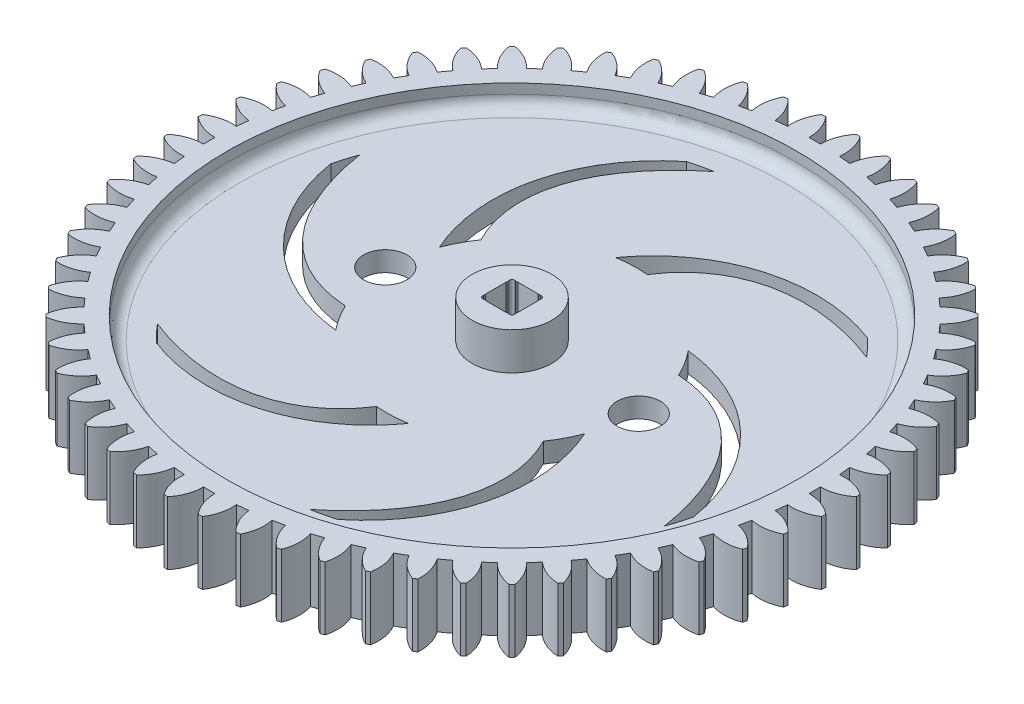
from build123d import *

# Parameters (mm, degrees)
EXTRUDE3_DEPTH     = 3.175
CIRPATTERN1_COUNT  = 60
CUT_EXTRUDE2_DEPTH = 9.52
CUT_EXTRUDE3_DEPTH = 2
CIRPATTERN2_COUNT  = 6
SKETCH8_R          = 2.175
CUT_EXTRUDE4_DEPTH = 2
FILLET1_R          = 0.25
FILLET2_R          = 1.2


with BuildPart() as part:
    # Sketch3 → Revolve1 (revolve)
    with BuildSketch(Plane.XY, mode=Mode.PRIVATE) as revolve1_sk:
        Polygon((0, 4.76), (4, 4.76), (4, 1), (28.61, 1), (28.61, 3.175), (30.41, 3.175), (30.41, -3.175), (28.61, -3.175), (28.61, -1), (4, -1), (4, -4.76), (0, -4.76), align=None)
    revolve(revolve1_sk.sketch.rotate(Axis((0, 37.828653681, 0), (0, -1, 0)), 90), axis=Axis((0, 37.828653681, 0), (0, -1, 0)))

    # Sketch4 → Extrude3 (add, symmetric)
    with BuildSketch(Plane(origin=(0, 0, 0), x_dir=(1, 0, 0), z_dir=(0, 1, 0))):
        with BuildLine():
            ThreePointArc((-1.532288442, 33.064514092), (-1.732320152, 33.0546376), (-1.932288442, 33.04355098))
            ThreePointArc((-1.932288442, 33.04355098), (-2.541297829, 31.594297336), (-2.574792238, 30.022640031))
            ThreePointArc((-2.574792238, 30.022640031), (-1.577031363, 30.091551), (-0.577533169, 30.127311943))
            ThreePointArc((-0.577533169, 30.127311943), (-0.775127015, 31.686858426), (-1.532288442, 33.064514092))
        make_face()
    extrude3 = extrude(amount=EXTRUDE3_DEPTH, both=True)

    # CirPattern1: Extrude3 ×60 about axis
    cirpattern1_axis = Axis((0, 0, 0), (0, 1, 0))
    for i in range(1, CIRPATTERN1_COUNT):
        add(extrude3.rotate(cirpattern1_axis, i * 360 / CIRPATTERN1_COUNT))

    # Sketch6 → Cut-Extrude2 (cut)
    with BuildSketch(Plane(origin=(0, 4.76, 0), x_dir=(1, 0, 0), z_dir=(0, 1, 0))):
        Polygon((-1.2325, 1.6125), (-1.6125, 1.6125), (-1.6125, 1.2325), (-1.563002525, 1.183002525), (-1.6125, 1.133505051), (-1.563002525, 1.084007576), (-1.6125, 1.034510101), (-1.6125, -1.034510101), (-1.563002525, -1.084007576), (-1.6125, -1.133505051), (-1.563002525, -1.183002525), (-1.6125, -1.2325), (-1.6125, -1.6125), (-1.2325, -1.6125), (-1.1825, -1.5425), (-1.1325, -1.6125), (-1.0825, -1.5425), (-1.0325, -1.6125), (1.0325, -1.6125), (1.0825, -1.5425), (1.1325, -1.6125), (1.1825, -1.5425), (1.2325, -1.6125), (1.6125, -1.6125), (1.6125, -1.2325), (1.563002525, -1.183002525), (1.6125, -1.133505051), (1.563002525, -1.084007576), (1.6125, -1.034510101), (1.6125, 1.034510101), (1.563002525, 1.084007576), (1.6125, 1.133505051), (1.563002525, 1.183002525), (1.6125, 1.2325), (1.6125, 1.6125), (1.2325, 1.6125), (1.1825, 1.5425), (1.1325, 1.6125), (1.0825, 1.5425), (1.0325, 1.6125), (-1.0325, 1.6125), (-1.0825, 1.5425), (-1.1325, 1.6125), (-1.1825, 1.5425), align=None)
    extrude(amount=-CUT_EXTRUDE2_DEPTH, mode=Mode.SUBTRACT)

    # Sketch7 → Cut-Extrude3 (cut)
    with BuildSketch(Plane(origin=(0, 1, 0), x_dir=(1, 0, 0), z_dir=(0, 1, 0))):
        with BuildLine():
            ThreePointArc((-4.536916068, 24.856803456), (-5.676289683, 24.621616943), (-6.803629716, 24.334233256))
            add(Edge.make_bspline(
                [(-6.803629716, 24.334233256), (-6.804563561, 24.333479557), (-7.547852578, 23.733459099), (-8.854847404, 22.490937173), (-10.398278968, 20.527816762), (-11.587284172, 18.47898053), (-12.454829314, 16.352427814), (-13.014668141, 14.151495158), (-13.265237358, 11.875832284), (-13.189292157, 9.521290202), (-12.748877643, 7.078747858), (-12.161559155, 5.367944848), (-11.76763305, 4.482614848), (-11.761883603, 4.469735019)],
                knots=[-0.000139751, -0.000139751, -0.000139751, -0.000139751, 0, 0.111111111, 0.222222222, 0.333333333, 0.444444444, 0.555555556, 0.666666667, 0.777777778, 0.888888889, 1, 1.001639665, 1.001639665, 1.001639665, 1.001639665], degree=3))
            ThreePointArc((-11.761883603, 4.469735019), (-11.128774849, 5.871184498), (-10.329431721, 7.184934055))
            add(Edge.make_bspline(
                [(-10.329431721, 7.184934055), (-10.331010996, 7.188034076), (-10.731075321, 7.974087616), (-11.312228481, 9.496486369), (-11.682921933, 11.668766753), (-11.639684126, 13.752670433), (-11.236545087, 15.759979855), (-10.507965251, 17.698178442), (-9.475630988, 19.571937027), (-8.151785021, 21.38384652), (-6.54093412, 23.134821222), (-5.257427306, 24.275782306), (-4.554802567, 24.842413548), (-4.536916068, 24.856803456)],
                knots=[-0.000439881, -0.000439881, -0.000439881, -0.000439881, 0, 0.111111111, 0.222222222, 0.333333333, 0.444444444, 0.555555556, 0.666666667, 0.777777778, 0.888888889, 1, 1.002896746, 1.002896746, 1.002896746, 1.002896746], degree=3))
        make_face()
    cut_extrude3 = extrude(amount=-CUT_EXTRUDE3_DEPTH, mode=Mode.SUBTRACT)

    # CirPattern2: Cut-Extrude3 ×6 about axis
    cirpattern2_axis = Axis((0, 37.828653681, 0), (0, -1, 0))
    for i in range(1, CIRPATTERN2_COUNT):
        add(cut_extrude3.rotate(cirpattern2_axis, i * 360 / CIRPATTERN2_COUNT), mode=Mode.SUBTRACT)

    # Sketch8 → Cut-Extrude4 (cut)
    with BuildSketch(Plane.XZ.offset(1)):
        with Locations(Location((-12.73, 0, 0), (0, 0, 270))):
            Circle(SKETCH8_R)
        with Locations(Location((12.73, 0, 0), (0, 0, 270))):
            Circle(SKETCH8_R)
    extrude(amount=-CUT_EXTRUDE4_DEPTH, mode=Mode.SUBTRACT)

    # Fillet1
    fillet1_edges = [part.edges().sort_by_distance(p)[0] for p in [
        (-1.6125, 0, -1.6125),
        (1.6125, 0, -1.6125),
        (1.6125, 0, 1.6125),
        (-1.6125, 0, 1.6125),
    ]]
    fillet(fillet1_edges, radius=FILLET1_R)

    # Fillet2
    fillet2_edges = [part.edges().sort_by_distance(p)[0] for p in [
        (0, -1, -28.61),
        (0, 1, -28.61),
    ]]
    fillet(fillet2_edges, radius=FILLET2_R)


solid = part.part
